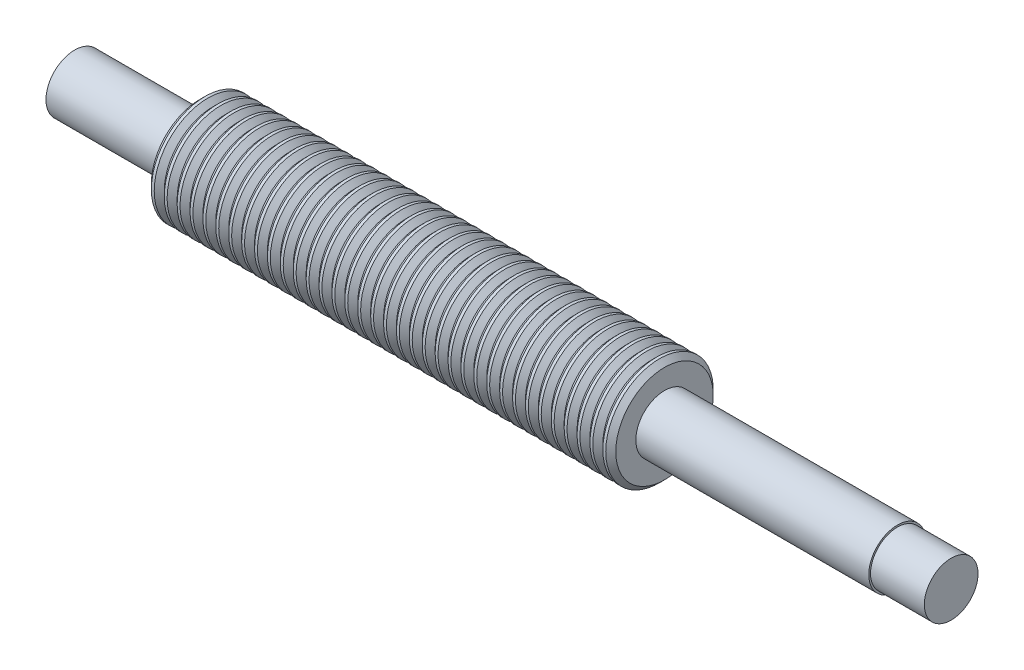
from build123d import *


with BuildPart() as part:
    # Skizze1 → Welle (revolve)
    with BuildSketch(Plane.XY, mode=Mode.PRIVATE) as welle_sk:
        Polygon((0, 0), (0, 40), (175, 40), (175, 68), (182, 75), (186, 75), (193, 68), (200, 75), (204, 75), (211, 68), (218, 75), (222, 75), (229, 68), (236, 75), (240, 75), (247, 68), (254, 75), (258, 75), (265, 68), (272, 75), (276, 75), (283, 68), (290, 75), (294, 75), (301, 68), (308, 75), (312, 75), (319, 68), (326, 75), (330, 75), (337, 68), (344, 75), (348, 75), (355, 68), (362, 75), (366, 75), (373, 68), (380, 75), (384, 75), (391, 68), (398, 75), (402, 75), (409, 68), (416, 75), (420, 75), (427, 68), (434, 75), (438, 75), (445, 68), (452, 75), (456, 75), (463, 68), (470, 75), (474, 75), (481, 68), (488, 75), (492, 75), (499, 68), (506, 75), (510, 75), (517, 68), (524, 75), (528, 75), (535, 68), (542, 75), (546, 75), (553, 68), (560, 75), (564, 75), (571, 68), (578, 75), (582, 75), (589, 68), (596, 75), (600, 75), (607, 68), (614, 75), (618, 75), (625, 68), (632, 75), (636, 75), (643, 68), (650, 75), (654, 75), (661, 68), (668, 75), (672, 75), (679, 68), (686, 75), (690, 75), (697, 68), (704, 75), (708, 75), (715, 68), (722, 75), (726, 75), (733, 68), (740, 75), (744, 75), (751, 68), (758, 75), (762, 75), (769, 68), (776, 75), (780, 75), (787, 68), (794, 75), (798, 75), (805, 68), (812, 75), (816, 75), (823, 68), (823, 40), (1148, 40), (1148, 37.5), (1223, 37.5), (1223, 0), align=None)
    revolve(welle_sk.sketch.rotate(Axis((0, 0, 0), (1, 0, 0)), 90), axis=Axis((0, 0, 0), (1, 0, 0)))


solid = part.part
